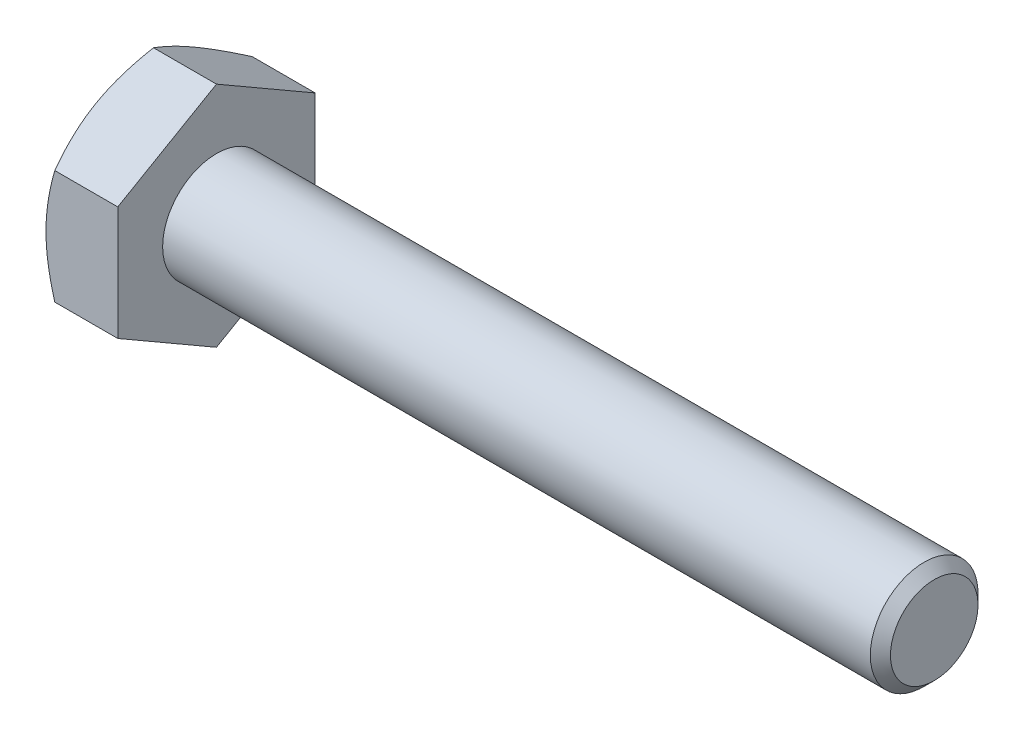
from build123d import *

# Parameters (mm, degrees)
BASEHEAD_DEPTH = 2


with BuildPart() as part:
    # Sketch1 → BaseHead (new body)
    with BuildSketch(Plane(origin=(0, 0, 0), x_dir=(0, 0, -1), z_dir=(1, 0, 0))):
        Polygon((2.75, 1.58771324), (2.75, -1.58771324), (0, -3.175426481), (-2.75, -1.58771324), (-2.75, 1.58771324), (0, 3.175426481), align=None)
    extrude(amount=BASEHEAD_DEPTH)

    # BodySke → BaseBody (revolve)
    with BuildSketch(Plane.XY, mode=Mode.PRIVATE) as basebody_sk:
        Polygon((0, 0), (22, 0), (22, 1.2195), (21.7195, 1.5), (0, 1.5), align=None)
    revolve(basebody_sk.sketch.rotate(Axis((0, 0, 0), (1, 0, 0)), 90), axis=Axis((0, 0, 0), (1, 0, 0)))

    # Sketch3 → HeadChamfer (revolve, cut)
    with BuildSketch(Plane.XY):
        Polygon((0, 2.75), (3.132371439, 8.175426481), (3.132371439, 13.175426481), (-10, 13.175426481), (-10, 2.75), align=None)
    revolve(axis=Axis((0, 0, 0), (1, 0, 0)), mode=Mode.SUBTRACT)


solid = part.part
